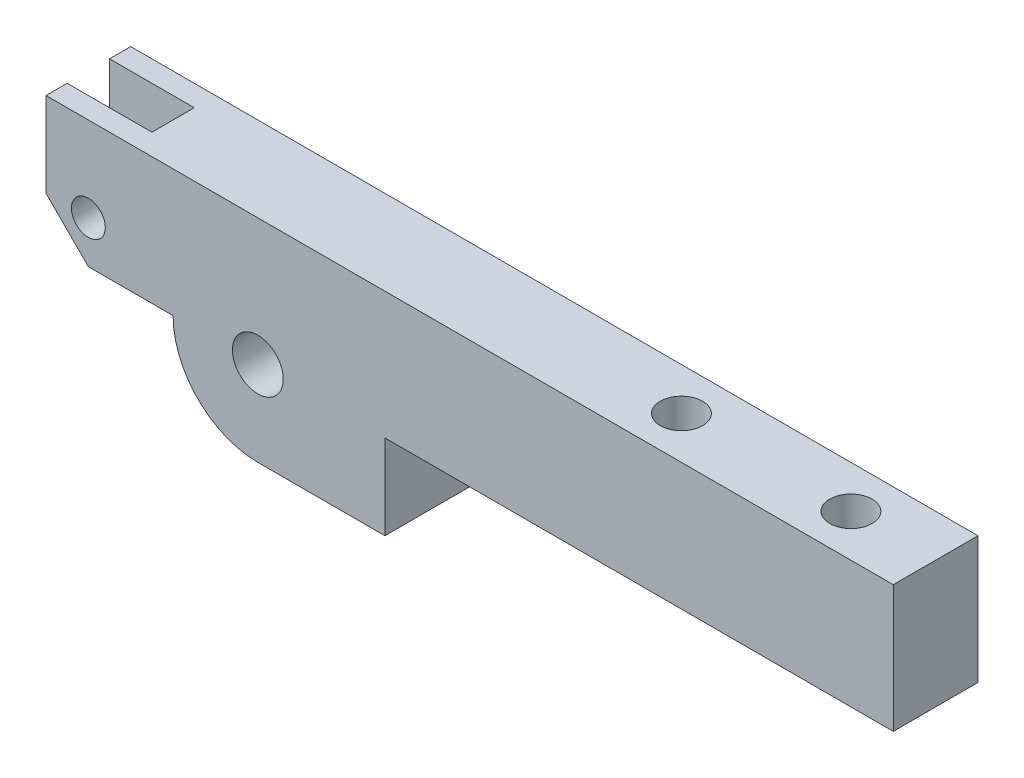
ISO-10303-21;
HEADER;
FILE_DESCRIPTION(('STEP AP214'),'2;1');
FILE_NAME('part.step','',(''),(''),'','','');
FILE_SCHEMA(('AUTOMOTIVE_DESIGN { 1 0 10303 214 1 1 1 1 }'));
ENDSEC;
DATA;
#1=APPLICATION_CONTEXT('core data for automotive mechanical design processes');
#2=APPLICATION_PROTOCOL_DEFINITION('international standard','automotive_design',2000,#1);
#3=PRODUCT_CONTEXT('',#1,'mechanical');
#4=PRODUCT('Part','Part','',(#3));
#5=PRODUCT_RELATED_PRODUCT_CATEGORY('part','',(#4));
#6=PRODUCT_DEFINITION_FORMATION('','',#4);
#7=PRODUCT_DEFINITION_CONTEXT('part definition',#1,'design');
#8=PRODUCT_DEFINITION('design','',#6,#7);
#9=PRODUCT_DEFINITION_SHAPE('','',#8);
#10=(LENGTH_UNIT() NAMED_UNIT(*) SI_UNIT(.MILLI.,.METRE.));
#11=(NAMED_UNIT(*) PLANE_ANGLE_UNIT() SI_UNIT($,.RADIAN.));
#12=(NAMED_UNIT(*) SI_UNIT($,.STERADIAN.) SOLID_ANGLE_UNIT());
#13=UNCERTAINTY_MEASURE_WITH_UNIT(LENGTH_MEASURE(1.E-05),#10,'distance_accuracy_value','');
#14=(GEOMETRIC_REPRESENTATION_CONTEXT(3) GLOBAL_UNCERTAINTY_ASSIGNED_CONTEXT((#13)) GLOBAL_UNIT_ASSIGNED_CONTEXT((#10,
#11,#12)) REPRESENTATION_CONTEXT('',''));
#15=CARTESIAN_POINT('',(0.,0.,0.));
#16=DIRECTION('',(0.,0.,1.));
#17=DIRECTION('',(1.,0.,0.));
#18=AXIS2_PLACEMENT_3D('',#15,#16,#17);
#19=CARTESIAN_POINT('',(-129.766525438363,-16.0117584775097,10.));
#20=DIRECTION('',(1.,0.,0.));
#21=DIRECTION('',(0.,0.,-1.));
#22=AXIS2_PLACEMENT_3D('',#19,#20,#21);
#23=PLANE('',#22);
#24=DIRECTION('',(0.,0.,-1.));
#25=VECTOR('',#24,1.);
#26=CARTESIAN_POINT('',(-129.766525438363,-1.01175847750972,10.));
#27=LINE('',#26,#25);
#28=CARTESIAN_POINT('',(-129.766525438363,-1.01175847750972,10.));
#29=VERTEX_POINT('',#28);
#30=CARTESIAN_POINT('',(-129.766525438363,-1.01175847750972,7.5));
#31=VERTEX_POINT('',#30);
#32=EDGE_CURVE('E241',#29,#31,#27,.T.);
#33=ORIENTED_EDGE('',*,*,#32,.T.);
#34=DIRECTION('',(0.,1.,0.));
#35=VECTOR('',#34,1.);
#36=CARTESIAN_POINT('',(-129.766525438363,-11.0117584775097,7.5));
#37=LINE('',#36,#35);
#38=CARTESIAN_POINT('',(-129.766525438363,-11.0117584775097,7.5));
#39=VERTEX_POINT('',#38);
#40=EDGE_CURVE('E158',#39,#31,#37,.T.);
#41=ORIENTED_EDGE('',*,*,#40,.F.);
#42=DIRECTION('',(0.,0.,1.));
#43=VECTOR('',#42,1.);
#44=CARTESIAN_POINT('',(-129.766525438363,-11.0117584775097,10.));
#45=LINE('',#44,#43);
#46=CARTESIAN_POINT('',(-129.766525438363,-11.0117584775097,10.));
#47=VERTEX_POINT('',#46);
#48=EDGE_CURVE('E268',#39,#47,#45,.T.);
#49=ORIENTED_EDGE('',*,*,#48,.T.);
#50=DIRECTION('',(0.,-1.,0.));
#51=VECTOR('',#50,1.);
#52=CARTESIAN_POINT('',(-129.766525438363,-16.0117584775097,10.));
#53=LINE('',#52,#51);
#54=EDGE_CURVE('E218',#29,#47,#53,.T.);
#55=ORIENTED_EDGE('',*,*,#54,.F.);
#56=EDGE_LOOP('',(#33,#41,#49,#55));
#57=FACE_BOUND('',#56,.T.);
#58=ADVANCED_FACE('F39',(#57),#23,.F.);
#59=CARTESIAN_POINT('',(-124.766525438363,-11.0117584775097,0.));
#60=DIRECTION('',(0.,0.,1.));
#61=DIRECTION('',(1.,0.,0.));
#62=AXIS2_PLACEMENT_3D('',#59,#60,#61);
#63=CYLINDRICAL_SURFACE('',#62,2.);
#64=CARTESIAN_POINT('',(-124.766525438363,-11.0117584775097,10.));
#65=DIRECTION('',(0.,0.,1.));
#66=DIRECTION('',(1.,0.,0.));
#67=AXIS2_PLACEMENT_3D('',#64,#65,#66);
#68=CIRCLE('',#67,2.);
#69=CARTESIAN_POINT('',(-122.766525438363,-11.0117584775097,10.));
#70=VERTEX_POINT('',#69);
#71=EDGE_CURVE('E202',#70,#70,#68,.T.);
#72=ORIENTED_EDGE('',*,*,#71,.T.);
#73=EDGE_LOOP('',(#72));
#74=FACE_BOUND('',#73,.T.);
#75=CARTESIAN_POINT('',(-124.766525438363,-11.0117584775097,0.));
#76=DIRECTION('',(0.,0.,1.));
#77=DIRECTION('',(1.,0.,0.));
#78=AXIS2_PLACEMENT_3D('',#75,#76,#77);
#79=CIRCLE('',#78,2.);
#80=CARTESIAN_POINT('',(-122.766525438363,-11.0117584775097,0.));
#81=VERTEX_POINT('',#80);
#82=EDGE_CURVE('E191',#81,#81,#79,.T.);
#83=ORIENTED_EDGE('',*,*,#82,.F.);
#84=EDGE_LOOP('',(#83));
#85=FACE_BOUND('',#84,.T.);
#86=DIRECTION('',(0.,0.,1.));
#87=VECTOR('',#86,1.);
#88=CARTESIAN_POINT('',(-126.766525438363,-11.0117584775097,0.));
#89=LINE('',#88,#87);
#90=CARTESIAN_POINT('',(-126.766525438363,-11.0117584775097,7.5));
#91=VERTEX_POINT('',#90);
#92=CARTESIAN_POINT('',(-126.766525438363,-11.0117584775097,2.5));
#93=VERTEX_POINT('',#92);
#94=EDGE_CURVE('E11',#91,#93,#89,.F.);
#95=ORIENTED_EDGE('',*,*,#94,.F.);
#96=CARTESIAN_POINT('',(-124.766525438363,-11.0117584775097,7.5));
#97=DIRECTION('',(0.,0.,1.));
#98=DIRECTION('',(1.,0.,0.));
#99=AXIS2_PLACEMENT_3D('',#96,#97,#98);
#100=CIRCLE('',#99,2.);
#101=CARTESIAN_POINT('',(-122.766525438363,-11.0117584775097,7.5));
#102=VERTEX_POINT('',#101);
#103=EDGE_CURVE('E48',#91,#102,#100,.F.);
#104=ORIENTED_EDGE('',*,*,#103,.T.);
#105=DIRECTION('',(0.,0.,1.));
#106=VECTOR('',#105,1.);
#107=CARTESIAN_POINT('',(-122.766525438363,-11.0117584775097,0.));
#108=LINE('',#107,#106);
#109=CARTESIAN_POINT('',(-122.766525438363,-11.0117584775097,2.5));
#110=VERTEX_POINT('',#109);
#111=EDGE_CURVE('E274',#110,#102,#108,.T.);
#112=ORIENTED_EDGE('',*,*,#111,.F.);
#113=CARTESIAN_POINT('',(-124.766525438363,-11.0117584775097,2.5));
#114=DIRECTION('',(0.,0.,-1.));
#115=DIRECTION('',(-1.,0.,0.));
#116=AXIS2_PLACEMENT_3D('',#113,#114,#115);
#117=CIRCLE('',#116,2.);
#118=EDGE_CURVE('E276',#110,#93,#117,.F.);
#119=ORIENTED_EDGE('',*,*,#118,.T.);
#120=EDGE_LOOP('',(#95,#104,#112,#119));
#121=FACE_BOUND('',#120,.T.);
#122=ADVANCED_FACE('F282',(#74,#85,#121),#63,.F.);
#123=CARTESIAN_POINT('',(-114.766525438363,-26.0117584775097,10.));
#124=DIRECTION('',(0.,1.,0.));
#125=DIRECTION('',(-1.,0.,0.));
#126=AXIS2_PLACEMENT_3D('',#123,#124,#125);
#127=PLANE('',#126);
#128=DIRECTION('',(1.,0.,0.));
#129=VECTOR('',#128,1.);
#130=CARTESIAN_POINT('',(-114.766525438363,-26.0117584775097,10.));
#131=LINE('',#130,#129);
#132=CARTESIAN_POINT('',(-104.766525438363,-26.0117584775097,10.));
#133=VERTEX_POINT('',#132);
#134=CARTESIAN_POINT('',(-89.7665254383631,-26.0117584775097,10.));
#135=VERTEX_POINT('',#134);
#136=EDGE_CURVE('E207',#133,#135,#131,.T.);
#137=ORIENTED_EDGE('',*,*,#136,.F.);
#138=DIRECTION('',(0.,0.,-1.));
#139=VECTOR('',#138,1.);
#140=CARTESIAN_POINT('',(-104.766525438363,-26.0117584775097,10.));
#141=LINE('',#140,#139);
#142=CARTESIAN_POINT('',(-104.766525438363,-26.0117584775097,0.));
#143=VERTEX_POINT('',#142);
#144=EDGE_CURVE('E255',#133,#143,#141,.T.);
#145=ORIENTED_EDGE('',*,*,#144,.T.);
#146=DIRECTION('',(1.,0.,0.));
#147=VECTOR('',#146,1.);
#148=CARTESIAN_POINT('',(-114.766525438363,-26.0117584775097,0.));
#149=LINE('',#148,#147);
#150=CARTESIAN_POINT('',(-89.7665254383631,-26.0117584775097,0.));
#151=VERTEX_POINT('',#150);
#152=EDGE_CURVE('E198',#143,#151,#149,.T.);
#153=ORIENTED_EDGE('',*,*,#152,.T.);
#154=DIRECTION('',(0.,0.,-1.));
#155=VECTOR('',#154,1.);
#156=CARTESIAN_POINT('',(-89.7665254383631,-26.0117584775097,10.));
#157=LINE('',#156,#155);
#158=EDGE_CURVE('E252',#135,#151,#157,.T.);
#159=ORIENTED_EDGE('',*,*,#158,.F.);
#160=EDGE_LOOP('',(#137,#145,#153,#159));
#161=FACE_BOUND('',#160,.T.);
#162=ADVANCED_FACE('F346',(#161),#127,.F.);
#163=CARTESIAN_POINT('',(-89.7665254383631,-26.0117584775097,10.));
#164=DIRECTION('',(-1.,0.,0.));
#165=DIRECTION('',(0.,0.,1.));
#166=AXIS2_PLACEMENT_3D('',#163,#164,#165);
#167=PLANE('',#166);
#168=DIRECTION('',(0.,1.,0.));
#169=VECTOR('',#168,1.);
#170=CARTESIAN_POINT('',(-89.7665254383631,-26.0117584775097,0.));
#171=LINE('',#170,#169);
#172=CARTESIAN_POINT('',(-89.7665254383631,-16.0117584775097,0.));
#173=VERTEX_POINT('',#172);
#174=EDGE_CURVE('E225',#151,#173,#171,.T.);
#175=ORIENTED_EDGE('',*,*,#174,.T.);
#176=DIRECTION('',(0.,0.,-1.));
#177=VECTOR('',#176,1.);
#178=CARTESIAN_POINT('',(-89.7665254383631,-16.0117584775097,10.));
#179=LINE('',#178,#177);
#180=CARTESIAN_POINT('',(-89.7665254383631,-16.0117584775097,10.));
#181=VERTEX_POINT('',#180);
#182=EDGE_CURVE('E249',#181,#173,#179,.T.);
#183=ORIENTED_EDGE('',*,*,#182,.F.);
#184=DIRECTION('',(0.,1.,0.));
#185=VECTOR('',#184,1.);
#186=CARTESIAN_POINT('',(-89.7665254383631,-26.0117584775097,10.));
#187=LINE('',#186,#185);
#188=EDGE_CURVE('E209',#135,#181,#187,.T.);
#189=ORIENTED_EDGE('',*,*,#188,.F.);
#190=ORIENTED_EDGE('',*,*,#158,.T.);
#191=EDGE_LOOP('',(#175,#183,#189,#190));
#192=FACE_BOUND('',#191,.T.);
#193=ADVANCED_FACE('F389',(#192),#167,.F.);
#194=CARTESIAN_POINT('',(-29.7665254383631,-16.0117584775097,10.));
#195=DIRECTION('',(0.,1.,0.));
#196=DIRECTION('',(-1.,0.,0.));
#197=AXIS2_PLACEMENT_3D('',#194,#195,#196);
#198=PLANE('',#197);
#199=DIRECTION('',(1.,0.,0.));
#200=VECTOR('',#199,1.);
#201=CARTESIAN_POINT('',(-29.7665254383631,-16.0117584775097,0.));
#202=LINE('',#201,#200);
#203=CARTESIAN_POINT('',(-29.7665254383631,-16.0117584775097,0.));
#204=VERTEX_POINT('',#203);
#205=EDGE_CURVE('E227',#173,#204,#202,.T.);
#206=ORIENTED_EDGE('',*,*,#205,.T.);
#207=DIRECTION('',(0.,0.,-1.));
#208=VECTOR('',#207,1.);
#209=CARTESIAN_POINT('',(-29.7665254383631,-16.0117584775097,10.));
#210=LINE('',#209,#208);
#211=CARTESIAN_POINT('',(-29.7665254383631,-16.0117584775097,10.));
#212=VERTEX_POINT('',#211);
#213=EDGE_CURVE('E246',#212,#204,#210,.T.);
#214=ORIENTED_EDGE('',*,*,#213,.F.);
#215=DIRECTION('',(1.,0.,0.));
#216=VECTOR('',#215,1.);
#217=CARTESIAN_POINT('',(-29.7665254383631,-16.0117584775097,10.));
#218=LINE('',#217,#216);
#219=EDGE_CURVE('E212',#181,#212,#218,.T.);
#220=ORIENTED_EDGE('',*,*,#219,.F.);
#221=ORIENTED_EDGE('',*,*,#182,.T.);
#222=EDGE_LOOP('',(#206,#214,#220,#221));
#223=FACE_BOUND('',#222,.T.);
#224=ADVANCED_FACE('F393',(#223),#198,.F.);
#225=CARTESIAN_POINT('',(-29.7665254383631,-1.01175847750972,10.));
#226=DIRECTION('',(-1.,0.,0.));
#227=DIRECTION('',(0.,0.,1.));
#228=AXIS2_PLACEMENT_3D('',#225,#226,#227);
#229=PLANE('',#228);
#230=DIRECTION('',(0.,1.,0.));
#231=VECTOR('',#230,1.);
#232=CARTESIAN_POINT('',(-29.7665254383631,-1.01175847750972,0.));
#233=LINE('',#232,#231);
#234=CARTESIAN_POINT('',(-29.7665254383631,-1.01175847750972,0.));
#235=VERTEX_POINT('',#234);
#236=EDGE_CURVE('E229',#204,#235,#233,.T.);
#237=ORIENTED_EDGE('',*,*,#236,.T.);
#238=DIRECTION('',(0.,0.,-1.));
#239=VECTOR('',#238,1.);
#240=CARTESIAN_POINT('',(-29.7665254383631,-1.01175847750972,10.));
#241=LINE('',#240,#239);
#242=CARTESIAN_POINT('',(-29.7665254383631,-1.01175847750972,10.));
#243=VERTEX_POINT('',#242);
#244=EDGE_CURVE('E243',#243,#235,#241,.T.);
#245=ORIENTED_EDGE('',*,*,#244,.F.);
#246=DIRECTION('',(0.,1.,0.));
#247=VECTOR('',#246,1.);
#248=CARTESIAN_POINT('',(-29.7665254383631,-1.01175847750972,10.));
#249=LINE('',#248,#247);
#250=EDGE_CURVE('E214',#212,#243,#249,.T.);
#251=ORIENTED_EDGE('',*,*,#250,.F.);
#252=ORIENTED_EDGE('',*,*,#213,.T.);
#253=EDGE_LOOP('',(#237,#245,#251,#252));
#254=FACE_BOUND('',#253,.T.);
#255=ADVANCED_FACE('F322',(#254),#229,.F.);
#256=CARTESIAN_POINT('',(-129.766525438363,-1.01175847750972,10.));
#257=DIRECTION('',(0.,-1.,0.));
#258=DIRECTION('',(0.,0.,-1.));
#259=AXIS2_PLACEMENT_3D('',#256,#257,#258);
#260=PLANE('',#259);
#261=CARTESIAN_POINT('',(-39.7665254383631,-1.01175847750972,5.));
#262=DIRECTION('',(0.,1.,0.));
#263=DIRECTION('',(0.,0.,1.));
#264=AXIS2_PLACEMENT_3D('',#261,#262,#263);
#265=CIRCLE('',#264,2.5);
#266=CARTESIAN_POINT('',(-39.7665254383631,-1.01175847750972,7.5));
#267=VERTEX_POINT('',#266);
#268=EDGE_CURVE('E175',#267,#267,#265,.T.);
#269=ORIENTED_EDGE('',*,*,#268,.F.);
#270=EDGE_LOOP('',(#269));
#271=FACE_BOUND('',#270,.T.);
#272=CARTESIAN_POINT('',(-59.7665254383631,-1.01175847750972,5.));
#273=DIRECTION('',(0.,1.,0.));
#274=DIRECTION('',(0.,0.,1.));
#275=AXIS2_PLACEMENT_3D('',#272,#273,#274);
#276=CIRCLE('',#275,2.5);
#277=CARTESIAN_POINT('',(-59.7665254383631,-1.01175847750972,7.5));
#278=VERTEX_POINT('',#277);
#279=EDGE_CURVE('E192',#278,#278,#276,.T.);
#280=ORIENTED_EDGE('',*,*,#279,.F.);
#281=EDGE_LOOP('',(#280));
#282=FACE_BOUND('',#281,.T.);
#283=DIRECTION('',(0.,0.,-1.));
#284=VECTOR('',#283,1.);
#285=CARTESIAN_POINT('',(-119.766525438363,-1.01175847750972,2.5));
#286=LINE('',#285,#284);
#287=CARTESIAN_POINT('',(-119.766525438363,-1.01175847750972,7.5));
#288=VERTEX_POINT('',#287);
#289=CARTESIAN_POINT('',(-119.766525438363,-1.01175847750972,2.5));
#290=VERTEX_POINT('',#289);
#291=EDGE_CURVE('E153',#288,#290,#286,.T.);
#292=ORIENTED_EDGE('',*,*,#291,.F.);
#293=DIRECTION('',(1.,0.,0.));
#294=VECTOR('',#293,1.);
#295=CARTESIAN_POINT('',(-129.766525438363,-1.01175847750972,7.5));
#296=LINE('',#295,#294);
#297=EDGE_CURVE('E161',#31,#288,#296,.T.);
#298=ORIENTED_EDGE('',*,*,#297,.F.);
#299=ORIENTED_EDGE('',*,*,#32,.F.);
#300=DIRECTION('',(-1.,0.,0.));
#301=VECTOR('',#300,1.);
#302=CARTESIAN_POINT('',(-129.766525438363,-1.01175847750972,10.));
#303=LINE('',#302,#301);
#304=EDGE_CURVE('E216',#243,#29,#303,.T.);
#305=ORIENTED_EDGE('',*,*,#304,.F.);
#306=ORIENTED_EDGE('',*,*,#244,.T.);
#307=DIRECTION('',(-1.,0.,0.));
#308=VECTOR('',#307,1.);
#309=CARTESIAN_POINT('',(-129.766525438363,-1.01175847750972,0.));
#310=LINE('',#309,#308);
#311=CARTESIAN_POINT('',(-129.766525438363,-1.01175847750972,0.));
#312=VERTEX_POINT('',#311);
#313=EDGE_CURVE('E231',#235,#312,#310,.T.);
#314=ORIENTED_EDGE('',*,*,#313,.T.);
#315=CARTESIAN_POINT('',(-129.766525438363,-1.01175847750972,2.5));
#316=VERTEX_POINT('',#315);
#317=EDGE_CURVE('E240',#316,#312,#27,.T.);
#318=ORIENTED_EDGE('',*,*,#317,.F.);
#319=DIRECTION('',(-1.,0.,0.));
#320=VECTOR('',#319,1.);
#321=CARTESIAN_POINT('',(-129.766525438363,-1.01175847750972,2.5));
#322=LINE('',#321,#320);
#323=EDGE_CURVE('E168',#290,#316,#322,.T.);
#324=ORIENTED_EDGE('',*,*,#323,.F.);
#325=EDGE_LOOP('',(#292,#298,#299,#305,#306,#314,#318,#324));
#326=FACE_BOUND('',#325,.T.);
#327=ADVANCED_FACE('F170',(#271,#282,#326),#260,.F.);
#328=CARTESIAN_POINT('',(-129.766525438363,-11.0117584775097,0.));
#329=VERTEX_POINT('',#328);
#330=CARTESIAN_POINT('',(-129.766525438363,-11.0117584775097,2.5));
#331=VERTEX_POINT('',#330);
#332=EDGE_CURVE('E269',#329,#331,#45,.T.);
#333=ORIENTED_EDGE('',*,*,#332,.T.);
#334=DIRECTION('',(0.,1.,0.));
#335=VECTOR('',#334,1.);
#336=CARTESIAN_POINT('',(-129.766525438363,-11.0117584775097,2.5));
#337=LINE('',#336,#335);
#338=EDGE_CURVE('E55',#331,#316,#337,.T.);
#339=ORIENTED_EDGE('',*,*,#338,.T.);
#340=ORIENTED_EDGE('',*,*,#317,.T.);
#341=DIRECTION('',(0.,-1.,0.));
#342=VECTOR('',#341,1.);
#343=CARTESIAN_POINT('',(-129.766525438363,-16.0117584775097,0.));
#344=LINE('',#343,#342);
#345=EDGE_CURVE('E234',#312,#329,#344,.T.);
#346=ORIENTED_EDGE('',*,*,#345,.T.);
#347=EDGE_LOOP('',(#333,#339,#340,#346));
#348=FACE_BOUND('',#347,.T.);
#349=ADVANCED_FACE('F291',(#348),#23,.F.);
#350=CARTESIAN_POINT('',(-114.766525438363,-16.0117584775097,10.));
#351=DIRECTION('',(0.,1.,0.));
#352=DIRECTION('',(-1.,0.,0.));
#353=AXIS2_PLACEMENT_3D('',#350,#351,#352);
#354=PLANE('',#353);
#355=DIRECTION('',(1.,0.,0.));
#356=VECTOR('',#355,1.);
#357=CARTESIAN_POINT('',(-114.766525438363,-16.0117584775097,10.));
#358=LINE('',#357,#356);
#359=CARTESIAN_POINT('',(-124.766525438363,-16.0117584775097,10.));
#360=VERTEX_POINT('',#359);
#361=CARTESIAN_POINT('',(-114.766525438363,-16.0117584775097,10.));
#362=VERTEX_POINT('',#361);
#363=EDGE_CURVE('E221',#360,#362,#358,.T.);
#364=ORIENTED_EDGE('',*,*,#363,.F.);
#365=DIRECTION('',(0.,0.,-1.));
#366=VECTOR('',#365,1.);
#367=CARTESIAN_POINT('',(-124.766525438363,-16.0117584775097,10.));
#368=LINE('',#367,#366);
#369=CARTESIAN_POINT('',(-124.766525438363,-16.0117584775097,0.));
#370=VERTEX_POINT('',#369);
#371=EDGE_CURVE('E263',#360,#370,#368,.T.);
#372=ORIENTED_EDGE('',*,*,#371,.T.);
#373=DIRECTION('',(1.,0.,0.));
#374=VECTOR('',#373,1.);
#375=CARTESIAN_POINT('',(-114.766525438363,-16.0117584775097,0.));
#376=LINE('',#375,#374);
#377=CARTESIAN_POINT('',(-114.766525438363,-16.0117584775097,0.));
#378=VERTEX_POINT('',#377);
#379=EDGE_CURVE('E210',#370,#378,#376,.T.);
#380=ORIENTED_EDGE('',*,*,#379,.T.);
#381=DIRECTION('',(0.,0.,-1.));
#382=VECTOR('',#381,1.);
#383=CARTESIAN_POINT('',(-114.766525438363,-16.0117584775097,10.));
#384=LINE('',#383,#382);
#385=EDGE_CURVE('E223',#362,#378,#384,.T.);
#386=ORIENTED_EDGE('',*,*,#385,.F.);
#387=EDGE_LOOP('',(#364,#372,#380,#386));
#388=FACE_BOUND('',#387,.T.);
#389=ADVANCED_FACE('F301',(#388),#354,.F.);
#390=CARTESIAN_POINT('',(0.,0.,10.));
#391=DIRECTION('',(0.,0.,1.));
#392=DIRECTION('',(1.,0.,0.));
#393=AXIS2_PLACEMENT_3D('',#390,#391,#392);
#394=PLANE('',#393);
#395=CARTESIAN_POINT('',(-104.766525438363,-16.0117584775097,10.));
#396=DIRECTION('',(0.,0.,1.));
#397=DIRECTION('',(1.,0.,0.));
#398=AXIS2_PLACEMENT_3D('',#395,#396,#397);
#399=CIRCLE('',#398,3.00000000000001);
#400=CARTESIAN_POINT('',(-101.766525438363,-16.0117584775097,10.));
#401=VERTEX_POINT('',#400);
#402=EDGE_CURVE('E199',#401,#401,#399,.T.);
#403=ORIENTED_EDGE('',*,*,#402,.F.);
#404=EDGE_LOOP('',(#403));
#405=FACE_BOUND('',#404,.T.);
#406=ORIENTED_EDGE('',*,*,#71,.F.);
#407=EDGE_LOOP('',(#406));
#408=FACE_BOUND('',#407,.T.);
#409=ORIENTED_EDGE('',*,*,#54,.T.);
#410=DIRECTION('',(-0.707106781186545,0.70710678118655,0.));
#411=VECTOR('',#410,1.);
#412=CARTESIAN_POINT('',(-70.3891419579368,-70.3891419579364,10.));
#413=LINE('',#412,#411);
#414=EDGE_CURVE('E272',#47,#360,#413,.F.);
#415=ORIENTED_EDGE('',*,*,#414,.T.);
#416=ORIENTED_EDGE('',*,*,#363,.T.);
#417=CARTESIAN_POINT('',(-104.766525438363,-16.0117584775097,10.));
#418=DIRECTION('',(0.,0.,1.));
#419=DIRECTION('',(1.,0.,0.));
#420=AXIS2_PLACEMENT_3D('',#417,#418,#419);
#421=CIRCLE('',#420,10.);
#422=EDGE_CURVE('E261',#362,#133,#421,.T.);
#423=ORIENTED_EDGE('',*,*,#422,.T.);
#424=ORIENTED_EDGE('',*,*,#136,.T.);
#425=ORIENTED_EDGE('',*,*,#188,.T.);
#426=ORIENTED_EDGE('',*,*,#219,.T.);
#427=ORIENTED_EDGE('',*,*,#250,.T.);
#428=ORIENTED_EDGE('',*,*,#304,.T.);
#429=EDGE_LOOP('',(#409,#415,#416,#423,#424,#425,#426,#427,#428));
#430=FACE_BOUND('',#429,.T.);
#431=ADVANCED_FACE('F305',(#405,#408,#430),#394,.T.);
#432=CARTESIAN_POINT('',(0.,0.,0.));
#433=DIRECTION('',(0.,0.,1.));
#434=DIRECTION('',(1.,0.,0.));
#435=AXIS2_PLACEMENT_3D('',#432,#433,#434);
#436=PLANE('',#435);
#437=CARTESIAN_POINT('',(-104.766525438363,-16.0117584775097,0.));
#438=DIRECTION('',(0.,0.,1.));
#439=DIRECTION('',(1.,0.,0.));
#440=AXIS2_PLACEMENT_3D('',#437,#438,#439);
#441=CIRCLE('',#440,3.00000000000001);
#442=CARTESIAN_POINT('',(-101.766525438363,-16.0117584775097,0.));
#443=VERTEX_POINT('',#442);
#444=EDGE_CURVE('E195',#443,#443,#441,.T.);
#445=ORIENTED_EDGE('',*,*,#444,.T.);
#446=EDGE_LOOP('',(#445));
#447=FACE_BOUND('',#446,.T.);
#448=ORIENTED_EDGE('',*,*,#82,.T.);
#449=EDGE_LOOP('',(#448));
#450=FACE_BOUND('',#449,.T.);
#451=ORIENTED_EDGE('',*,*,#379,.F.);
#452=DIRECTION('',(0.707106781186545,-0.70710678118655,0.));
#453=VECTOR('',#452,1.);
#454=CARTESIAN_POINT('',(-124.766525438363,-16.0117584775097,0.));
#455=LINE('',#454,#453);
#456=EDGE_CURVE('E266',#370,#329,#455,.F.);
#457=ORIENTED_EDGE('',*,*,#456,.T.);
#458=ORIENTED_EDGE('',*,*,#345,.F.);
#459=ORIENTED_EDGE('',*,*,#313,.F.);
#460=ORIENTED_EDGE('',*,*,#236,.F.);
#461=ORIENTED_EDGE('',*,*,#205,.F.);
#462=ORIENTED_EDGE('',*,*,#174,.F.);
#463=ORIENTED_EDGE('',*,*,#152,.F.);
#464=CARTESIAN_POINT('',(-104.766525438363,-16.0117584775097,0.));
#465=DIRECTION('',(0.,0.,1.));
#466=DIRECTION('',(1.,0.,0.));
#467=AXIS2_PLACEMENT_3D('',#464,#465,#466);
#468=CIRCLE('',#467,10.);
#469=EDGE_CURVE('E258',#143,#378,#468,.F.);
#470=ORIENTED_EDGE('',*,*,#469,.T.);
#471=EDGE_LOOP('',(#451,#457,#458,#459,#460,#461,#462,#463,#470));
#472=FACE_BOUND('',#471,.T.);
#473=ADVANCED_FACE('F296',(#447,#450,#472),#436,.F.);
#474=CARTESIAN_POINT('',(-104.766525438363,-16.0117584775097,10.));
#475=DIRECTION('',(0.,0.,-1.));
#476=DIRECTION('',(-1.,0.,0.));
#477=AXIS2_PLACEMENT_3D('',#474,#475,#476);
#478=CYLINDRICAL_SURFACE('',#477,10.);
#479=ORIENTED_EDGE('',*,*,#422,.F.);
#480=ORIENTED_EDGE('',*,*,#385,.T.);
#481=ORIENTED_EDGE('',*,*,#469,.F.);
#482=ORIENTED_EDGE('',*,*,#144,.F.);
#483=EDGE_LOOP('',(#479,#480,#481,#482));
#484=FACE_BOUND('',#483,.T.);
#485=ADVANCED_FACE('F361',(#484),#478,.T.);
#486=CARTESIAN_POINT('',(-124.766525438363,-16.0117584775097,10.));
#487=DIRECTION('',(0.70710678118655,0.707106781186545,0.));
#488=DIRECTION('',(0.,0.,-1.));
#489=AXIS2_PLACEMENT_3D('',#486,#487,#488);
#490=PLANE('',#489);
#491=ORIENTED_EDGE('',*,*,#414,.F.);
#492=ORIENTED_EDGE('',*,*,#48,.F.);
#493=DIRECTION('',(0.,0.,1.));
#494=VECTOR('',#493,1.);
#495=CARTESIAN_POINT('',(-129.766525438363,-11.0117584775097,2.5));
#496=LINE('',#495,#494);
#497=EDGE_CURVE('E182',#331,#39,#496,.T.);
#498=ORIENTED_EDGE('',*,*,#497,.F.);
#499=ORIENTED_EDGE('',*,*,#332,.F.);
#500=ORIENTED_EDGE('',*,*,#456,.F.);
#501=ORIENTED_EDGE('',*,*,#371,.F.);
#502=EDGE_LOOP('',(#491,#492,#498,#499,#500,#501));
#503=FACE_BOUND('',#502,.T.);
#504=ADVANCED_FACE('F42',(#503),#490,.F.);
#505=CARTESIAN_POINT('',(-104.766525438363,-16.0117584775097,0.));
#506=DIRECTION('',(0.,0.,1.));
#507=DIRECTION('',(1.,0.,0.));
#508=AXIS2_PLACEMENT_3D('',#505,#506,#507);
#509=CYLINDRICAL_SURFACE('',#508,3.00000000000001);
#510=ORIENTED_EDGE('',*,*,#444,.F.);
#511=EDGE_LOOP('',(#510));
#512=FACE_BOUND('',#511,.T.);
#513=ORIENTED_EDGE('',*,*,#402,.T.);
#514=EDGE_LOOP('',(#513));
#515=FACE_BOUND('',#514,.T.);
#516=ADVANCED_FACE('F363',(#512,#515),#509,.F.);
#517=CARTESIAN_POINT('',(-129.766525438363,-11.0117584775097,7.5));
#518=DIRECTION('',(0.,0.,1.));
#519=DIRECTION('',(1.,0.,0.));
#520=AXIS2_PLACEMENT_3D('',#517,#518,#519);
#521=PLANE('',#520);
#522=DIRECTION('',(1.,0.,0.));
#523=VECTOR('',#522,1.);
#524=CARTESIAN_POINT('',(-129.766525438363,-11.0117584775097,7.5));
#525=LINE('',#524,#523);
#526=EDGE_CURVE('E179',#39,#91,#525,.T.);
#527=ORIENTED_EDGE('',*,*,#526,.F.);
#528=ORIENTED_EDGE('',*,*,#40,.T.);
#529=ORIENTED_EDGE('',*,*,#297,.T.);
#530=DIRECTION('',(0.,1.,0.));
#531=VECTOR('',#530,1.);
#532=CARTESIAN_POINT('',(-119.766525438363,-11.0117584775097,7.5));
#533=LINE('',#532,#531);
#534=CARTESIAN_POINT('',(-119.766525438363,-11.0117584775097,7.5));
#535=VERTEX_POINT('',#534);
#536=EDGE_CURVE('E149',#535,#288,#533,.T.);
#537=ORIENTED_EDGE('',*,*,#536,.F.);
#538=EDGE_CURVE('E183',#102,#535,#525,.T.);
#539=ORIENTED_EDGE('',*,*,#538,.F.);
#540=ORIENTED_EDGE('',*,*,#103,.F.);
#541=EDGE_LOOP('',(#527,#528,#529,#537,#539,#540));
#542=FACE_BOUND('',#541,.T.);
#543=ADVANCED_FACE('F163',(#542),#521,.F.);
#544=CARTESIAN_POINT('',(-129.766525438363,-11.0117584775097,2.5));
#545=DIRECTION('',(0.,0.,-1.));
#546=DIRECTION('',(-1.,0.,0.));
#547=AXIS2_PLACEMENT_3D('',#544,#545,#546);
#548=PLANE('',#547);
#549=DIRECTION('',(-1.,0.,0.));
#550=VECTOR('',#549,1.);
#551=CARTESIAN_POINT('',(-129.766525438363,-11.0117584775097,2.5));
#552=LINE('',#551,#550);
#553=CARTESIAN_POINT('',(-119.766525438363,-11.0117584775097,2.5));
#554=VERTEX_POINT('',#553);
#555=EDGE_CURVE('E63',#554,#110,#552,.T.);
#556=ORIENTED_EDGE('',*,*,#555,.F.);
#557=DIRECTION('',(0.,1.,0.));
#558=VECTOR('',#557,1.);
#559=CARTESIAN_POINT('',(-119.766525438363,-11.0117584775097,2.5));
#560=LINE('',#559,#558);
#561=EDGE_CURVE('E311',#554,#290,#560,.T.);
#562=ORIENTED_EDGE('',*,*,#561,.T.);
#563=ORIENTED_EDGE('',*,*,#323,.T.);
#564=ORIENTED_EDGE('',*,*,#338,.F.);
#565=EDGE_CURVE('E185',#93,#331,#552,.T.);
#566=ORIENTED_EDGE('',*,*,#565,.F.);
#567=ORIENTED_EDGE('',*,*,#118,.F.);
#568=EDGE_LOOP('',(#556,#562,#563,#564,#566,#567));
#569=FACE_BOUND('',#568,.T.);
#570=ADVANCED_FACE('F370',(#569),#548,.F.);
#571=CARTESIAN_POINT('',(0.,-11.0117584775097,0.));
#572=DIRECTION('',(0.,1.,0.));
#573=DIRECTION('',(0.,0.,1.));
#574=AXIS2_PLACEMENT_3D('',#571,#572,#573);
#575=PLANE('',#574);
#576=ORIENTED_EDGE('',*,*,#94,.T.);
#577=ORIENTED_EDGE('',*,*,#565,.T.);
#578=ORIENTED_EDGE('',*,*,#497,.T.);
#579=ORIENTED_EDGE('',*,*,#526,.T.);
#580=EDGE_LOOP('',(#576,#577,#578,#579));
#581=FACE_BOUND('',#580,.T.);
#582=ADVANCED_FACE('F284',(#581),#575,.T.);
#583=ORIENTED_EDGE('',*,*,#111,.T.);
#584=ORIENTED_EDGE('',*,*,#538,.T.);
#585=DIRECTION('',(0.,0.,-1.));
#586=VECTOR('',#585,1.);
#587=CARTESIAN_POINT('',(-119.766525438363,-11.0117584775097,2.5));
#588=LINE('',#587,#586);
#589=EDGE_CURVE('E155',#535,#554,#588,.T.);
#590=ORIENTED_EDGE('',*,*,#589,.T.);
#591=ORIENTED_EDGE('',*,*,#555,.T.);
#592=EDGE_LOOP('',(#583,#584,#590,#591));
#593=FACE_BOUND('',#592,.T.);
#594=ADVANCED_FACE('F337',(#593),#575,.T.);
#595=CARTESIAN_POINT('',(-119.766525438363,-11.0117584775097,2.5));
#596=DIRECTION('',(1.,0.,0.));
#597=DIRECTION('',(0.,0.,-1.));
#598=AXIS2_PLACEMENT_3D('',#595,#596,#597);
#599=PLANE('',#598);
#600=ORIENTED_EDGE('',*,*,#291,.T.);
#601=ORIENTED_EDGE('',*,*,#561,.F.);
#602=ORIENTED_EDGE('',*,*,#589,.F.);
#603=ORIENTED_EDGE('',*,*,#536,.T.);
#604=EDGE_LOOP('',(#600,#601,#602,#603));
#605=FACE_BOUND('',#604,.T.);
#606=ADVANCED_FACE('F151',(#605),#599,.F.);
#607=CARTESIAN_POINT('',(-59.7665254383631,-11.0117584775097,5.));
#608=DIRECTION('',(0.,1.,0.));
#609=DIRECTION('',(0.,0.,1.));
#610=AXIS2_PLACEMENT_3D('',#607,#608,#609);
#611=CYLINDRICAL_SURFACE('',#610,2.5);
#612=CARTESIAN_POINT('',(-59.7665254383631,-11.0117584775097,5.));
#613=DIRECTION('',(0.,1.,0.));
#614=DIRECTION('',(0.,0.,1.));
#615=AXIS2_PLACEMENT_3D('',#612,#613,#614);
#616=CIRCLE('',#615,2.5);
#617=CARTESIAN_POINT('',(-59.7665254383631,-11.0117584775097,7.5));
#618=VERTEX_POINT('',#617);
#619=EDGE_CURVE('E188',#618,#618,#616,.T.);
#620=ORIENTED_EDGE('',*,*,#619,.F.);
#621=EDGE_LOOP('',(#620));
#622=FACE_BOUND('',#621,.T.);
#623=ORIENTED_EDGE('',*,*,#279,.T.);
#624=EDGE_LOOP('',(#623));
#625=FACE_BOUND('',#624,.T.);
#626=ADVANCED_FACE('F326',(#622,#625),#611,.F.);
#627=CARTESIAN_POINT('',(-59.7665254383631,-11.0117584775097,5.));
#628=DIRECTION('',(0.,1.,0.));
#629=DIRECTION('',(0.,0.,1.));
#630=AXIS2_PLACEMENT_3D('',#627,#628,#629);
#631=PLANE('',#630);
#632=ORIENTED_EDGE('',*,*,#619,.T.);
#633=EDGE_LOOP('',(#632));
#634=FACE_BOUND('',#633,.T.);
#635=ADVANCED_FACE('F328',(#634),#631,.T.);
#636=CARTESIAN_POINT('',(-39.7665254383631,-11.0117584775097,5.));
#637=DIRECTION('',(0.,1.,0.));
#638=DIRECTION('',(0.,0.,1.));
#639=AXIS2_PLACEMENT_3D('',#636,#637,#638);
#640=CYLINDRICAL_SURFACE('',#639,2.5);
#641=CARTESIAN_POINT('',(-39.7665254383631,-11.0117584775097,5.));
#642=DIRECTION('',(0.,1.,0.));
#643=DIRECTION('',(0.,0.,1.));
#644=AXIS2_PLACEMENT_3D('',#641,#642,#643);
#645=CIRCLE('',#644,2.5);
#646=CARTESIAN_POINT('',(-39.7665254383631,-11.0117584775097,7.5));
#647=VERTEX_POINT('',#646);
#648=EDGE_CURVE('E172',#647,#647,#645,.T.);
#649=ORIENTED_EDGE('',*,*,#648,.F.);
#650=EDGE_LOOP('',(#649));
#651=FACE_BOUND('',#650,.T.);
#652=ORIENTED_EDGE('',*,*,#268,.T.);
#653=EDGE_LOOP('',(#652));
#654=FACE_BOUND('',#653,.T.);
#655=ADVANCED_FACE('F318',(#651,#654),#640,.F.);
#656=CARTESIAN_POINT('',(-39.7665254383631,-11.0117584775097,5.));
#657=DIRECTION('',(0.,1.,0.));
#658=DIRECTION('',(0.,0.,1.));
#659=AXIS2_PLACEMENT_3D('',#656,#657,#658);
#660=PLANE('',#659);
#661=ORIENTED_EDGE('',*,*,#648,.T.);
#662=EDGE_LOOP('',(#661));
#663=FACE_BOUND('',#662,.T.);
#664=ADVANCED_FACE('F499',(#663),#660,.T.);
#665=CLOSED_SHELL('',(#58,#122,#162,#193,#224,#255,#327,#349,#389,#431,#473,#485,#504,#516,#543,
#570,#582,#594,#606,#626,#635,#655,#664));
#666=MANIFOLD_SOLID_BREP('B2',#665);
#667=ADVANCED_BREP_SHAPE_REPRESENTATION('',(#18,#666),#14);
#668=SHAPE_DEFINITION_REPRESENTATION(#9,#667);
ENDSEC;
END-ISO-10303-21;
